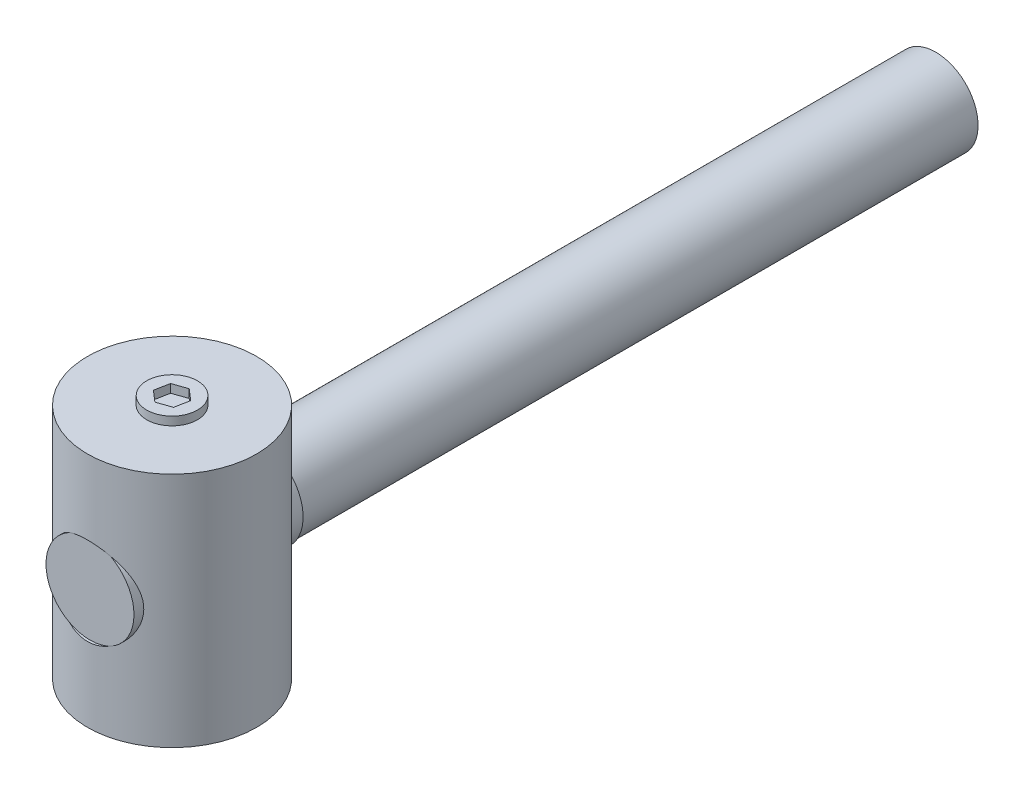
ISO-10303-21;
HEADER;
FILE_DESCRIPTION(('STEP AP214'),'2;1');
FILE_NAME('part.step','',(''),(''),'','','');
FILE_SCHEMA(('AUTOMOTIVE_DESIGN { 1 0 10303 214 1 1 1 1 }'));
ENDSEC;
DATA;
#1=APPLICATION_CONTEXT('core data for automotive mechanical design processes');
#2=APPLICATION_PROTOCOL_DEFINITION('international standard','automotive_design',2000,#1);
#3=PRODUCT_CONTEXT('',#1,'mechanical');
#4=PRODUCT('Part','Part','',(#3));
#5=PRODUCT_RELATED_PRODUCT_CATEGORY('part','',(#4));
#6=PRODUCT_DEFINITION_FORMATION('','',#4);
#7=PRODUCT_DEFINITION_CONTEXT('part definition',#1,'design');
#8=PRODUCT_DEFINITION('design','',#6,#7);
#9=PRODUCT_DEFINITION_SHAPE('','',#8);
#10=(LENGTH_UNIT() NAMED_UNIT(*) SI_UNIT(.MILLI.,.METRE.));
#11=(NAMED_UNIT(*) PLANE_ANGLE_UNIT() SI_UNIT($,.RADIAN.));
#12=(NAMED_UNIT(*) SI_UNIT($,.STERADIAN.) SOLID_ANGLE_UNIT());
#13=UNCERTAINTY_MEASURE_WITH_UNIT(LENGTH_MEASURE(1.E-05),#10,'distance_accuracy_value','');
#14=(GEOMETRIC_REPRESENTATION_CONTEXT(3) GLOBAL_UNCERTAINTY_ASSIGNED_CONTEXT((#13)) GLOBAL_UNIT_ASSIGNED_CONTEXT((#10,
#11,#12)) REPRESENTATION_CONTEXT('',''));
#15=CARTESIAN_POINT('',(0.,0.,0.));
#16=DIRECTION('',(0.,0.,1.));
#17=DIRECTION('',(1.,0.,0.));
#18=AXIS2_PLACEMENT_3D('',#15,#16,#17);
#19=CARTESIAN_POINT('',(0.,-7.,0.));
#20=DIRECTION('',(0.,1.,0.));
#21=DIRECTION('',(-1.,0.,0.));
#22=AXIS2_PLACEMENT_3D('',#19,#20,#21);
#23=CYLINDRICAL_SURFACE('',#22,5.);
#24=CARTESIAN_POINT('',(0.,-7.,0.));
#25=DIRECTION('',(0.,-1.,0.));
#26=DIRECTION('',(1.,0.,0.));
#27=AXIS2_PLACEMENT_3D('',#24,#25,#26);
#28=CIRCLE('',#27,5.);
#29=CARTESIAN_POINT('',(5.,-7.,0.));
#30=VERTEX_POINT('',#29);
#31=EDGE_CURVE('E157',#30,#30,#28,.T.);
#32=ORIENTED_EDGE('',*,*,#31,.F.);
#33=EDGE_LOOP('',(#32));
#34=FACE_BOUND('',#33,.T.);
#35=CARTESIAN_POINT('',(0.,7.,0.));
#36=DIRECTION('',(0.,-1.,0.));
#37=DIRECTION('',(1.,0.,0.));
#38=AXIS2_PLACEMENT_3D('',#35,#36,#37);
#39=CIRCLE('',#38,5.);
#40=CARTESIAN_POINT('',(5.,7.,0.));
#41=VERTEX_POINT('',#40);
#42=EDGE_CURVE('E124',#41,#41,#39,.T.);
#43=ORIENTED_EDGE('',*,*,#42,.T.);
#44=EDGE_LOOP('',(#43));
#45=FACE_BOUND('',#44,.T.);
#46=CARTESIAN_POINT('',(1.3,-2.25166604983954,-4.8280430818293));
#47=CARTESIAN_POINT('',(1.43082347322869,-2.17613041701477,-4.79281274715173));
#48=CARTESIAN_POINT('',(1.55444447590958,-2.08952355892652,-4.75378790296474));
#49=CARTESIAN_POINT('',(1.78454989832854,-1.89684283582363,-4.67229914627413));
#50=CARTESIAN_POINT('',(1.89098389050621,-1.79071357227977,-4.62982564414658));
#51=CARTESIAN_POINT('',(2.08420473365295,-1.56158048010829,-4.54611438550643));
#52=CARTESIAN_POINT('',(2.17100755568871,-1.43859050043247,-4.50487564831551));
#53=CARTESIAN_POINT('',(2.32271575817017,-1.1779818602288,-4.42856997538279));
#54=CARTESIAN_POINT('',(2.38764225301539,-1.04037747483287,-4.39349710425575));
#55=CARTESIAN_POINT('',(2.46595873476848,-0.827406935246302,-4.34970179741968));
#56=CARTESIAN_POINT('',(2.48871434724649,-0.756252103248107,-4.33668270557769));
#57=CARTESIAN_POINT('',(2.52810522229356,-0.611783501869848,-4.3138387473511));
#58=CARTESIAN_POINT('',(2.54474389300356,-0.538470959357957,-4.30401210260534));
#59=CARTESIAN_POINT('',(2.57163027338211,-0.390353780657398,-4.28800252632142));
#60=CARTESIAN_POINT('',(2.58188372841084,-0.315550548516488,-4.28181631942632));
#61=CARTESIAN_POINT('',(2.5958506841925,-0.165143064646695,-4.27336143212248));
#62=CARTESIAN_POINT('',(2.59956520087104,-0.0895389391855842,-4.27109214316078));
#63=CARTESIAN_POINT('',(2.6006477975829,0.11638936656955,-4.27044356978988));
#64=CARTESIAN_POINT('',(2.59150358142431,0.246838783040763,-4.27605204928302));
#65=CARTESIAN_POINT('',(2.55402251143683,0.503868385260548,-4.29853605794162));
#66=CARTESIAN_POINT('',(2.52568032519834,0.630447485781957,-4.31541471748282));
#67=CARTESIAN_POINT('',(2.45183589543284,0.874324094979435,-4.3577815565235));
#68=CARTESIAN_POINT('',(2.40665517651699,0.991748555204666,-4.38310754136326));
#69=CARTESIAN_POINT('',(2.30060316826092,1.21771266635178,-4.43968786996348));
#70=CARTESIAN_POINT('',(2.23972628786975,1.32624913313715,-4.47094432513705));
#71=CARTESIAN_POINT('',(2.09474942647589,1.54648172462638,-4.54084877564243));
#72=CARTESIAN_POINT('',(2.00865146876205,1.65672757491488,-4.57992862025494));
#73=CARTESIAN_POINT('',(1.81991423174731,1.86209107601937,-4.65814935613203));
#74=CARTESIAN_POINT('',(1.7172636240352,1.95719827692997,-4.69729027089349));
#75=CARTESIAN_POINT('',(1.48782333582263,2.13762229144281,-4.77517038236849));
#76=CARTESIAN_POINT('',(1.35972503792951,2.22142577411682,-4.81359427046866));
#77=CARTESIAN_POINT('',(1.08901824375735,2.36591075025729,-4.88195400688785));
#78=CARTESIAN_POINT('',(0.946418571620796,2.42660619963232,-4.9118949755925));
#79=CARTESIAN_POINT('',(0.660494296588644,2.51889024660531,-4.9581570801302));
#80=CARTESIAN_POINT('',(0.517827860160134,2.55212373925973,-4.97524130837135));
#81=CARTESIAN_POINT('',(0.228040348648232,2.5941060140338,-4.99690393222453));
#82=CARTESIAN_POINT('',(0.080922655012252,2.60287293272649,-5.00149159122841));
#83=CARTESIAN_POINT('',(-0.197852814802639,2.59583206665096,-4.9978348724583));
#84=CARTESIAN_POINT('',(-0.329594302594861,2.58237944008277,-4.99082017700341));
#85=CARTESIAN_POINT('',(-0.588635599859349,2.53590678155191,-4.96693327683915));
#86=CARTESIAN_POINT('',(-0.715935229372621,2.50288595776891,-4.95006067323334));
#87=CARTESIAN_POINT('',(-0.963054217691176,2.41859700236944,-4.90798145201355));
#88=CARTESIAN_POINT('',(-1.08286119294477,2.3672995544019,-4.88276144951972));
#89=CARTESIAN_POINT('',(-1.31236116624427,2.2482079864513,-4.82614733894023));
#90=CARTESIAN_POINT('',(-1.42205105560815,2.18040881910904,-4.79475134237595));
#91=CARTESIAN_POINT('',(-1.63946228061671,2.02283839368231,-4.7250829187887));
#92=CARTESIAN_POINT('',(-1.74599052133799,1.93158530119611,-4.6864399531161));
#93=CARTESIAN_POINT('',(-1.9429742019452,1.7333211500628,-4.60826495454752));
#94=CARTESIAN_POINT('',(-2.03341550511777,1.62629638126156,-4.56873217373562));
#95=CARTESIAN_POINT('',(-2.2030656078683,1.38905775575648,-4.48953925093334));
#96=CARTESIAN_POINT('',(-2.28075240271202,1.25766359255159,-4.45013273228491));
#97=CARTESIAN_POINT('',(-2.41256068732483,0.981267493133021,-4.380088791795));
#98=CARTESIAN_POINT('',(-2.46670227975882,0.83627729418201,-4.34944389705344));
#99=CARTESIAN_POINT('',(-2.52681737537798,0.61682763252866,-4.3145874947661));
#100=CARTESIAN_POINT('',(-2.54308972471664,0.545909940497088,-4.30498876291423));
#101=CARTESIAN_POINT('',(-2.56967004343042,0.402608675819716,-4.28917713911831));
#102=CARTESIAN_POINT('',(-2.57998129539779,0.33022593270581,-4.28296238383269));
#103=CARTESIAN_POINT('',(-2.59446337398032,0.18467441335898,-4.27420550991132));
#104=CARTESIAN_POINT('',(-2.59863830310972,0.1115061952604,-4.27166093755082));
#105=CARTESIAN_POINT('',(-2.60079785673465,-0.0349319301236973,-4.27034489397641));
#106=CARTESIAN_POINT('',(-2.59878312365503,-0.108201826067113,-4.27157303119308));
#107=CARTESIAN_POINT('',(-2.58480725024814,-0.308050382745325,-4.2800612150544));
#108=CARTESIAN_POINT('',(-2.56660734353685,-0.434099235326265,-4.29110126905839));
#109=CARTESIAN_POINT('',(-2.5124380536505,-0.680933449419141,-4.3230323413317));
#110=CARTESIAN_POINT('',(-2.47646219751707,-0.801716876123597,-4.343926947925));
#111=CARTESIAN_POINT('',(-2.38692669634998,-1.03878867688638,-4.39377582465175));
#112=CARTESIAN_POINT('',(-2.33290221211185,-1.15485599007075,-4.42293969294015));
#113=CARTESIAN_POINT('',(-2.20916180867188,-1.37687354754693,-4.48602514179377));
#114=CARTESIAN_POINT('',(-2.13943861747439,-1.48281907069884,-4.51994892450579));
#115=CARTESIAN_POINT('',(-1.97500467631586,-1.69706491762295,-4.59440733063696));
#116=CARTESIAN_POINT('',(-1.87816844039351,-1.80364878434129,-4.63520575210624));
#117=CARTESIAN_POINT('',(-1.66780789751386,-1.99977754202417,-4.71498418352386));
#118=CARTESIAN_POINT('',(-1.55427472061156,-2.08931331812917,-4.75396321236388));
#119=CARTESIAN_POINT('',(-1.30655803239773,-2.25300013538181,-4.82808630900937));
#120=CARTESIAN_POINT('',(-1.17162691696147,-2.32616092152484,-4.86294207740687));
#121=CARTESIAN_POINT('',(-0.889095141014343,-2.448085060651,-4.92242581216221));
#122=CARTESIAN_POINT('',(-0.741506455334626,-2.4968711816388,-4.94706331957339));
#123=CARTESIAN_POINT('',(-0.45201824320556,-2.56432345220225,-4.9814653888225));
#124=CARTESIAN_POINT('',(-0.310791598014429,-2.58529438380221,-4.99236364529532));
#125=CARTESIAN_POINT('',(-0.0263743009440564,-2.60376325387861,-5.00195069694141));
#126=CARTESIAN_POINT('',(0.116815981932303,-2.6012655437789,-5.00064175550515));
#127=CARTESIAN_POINT('',(0.38843535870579,-2.57414292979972,-4.98659254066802));
#128=CARTESIAN_POINT('',(0.517106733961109,-2.55136287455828,-4.97480547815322));
#129=CARTESIAN_POINT('',(0.768393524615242,-2.48723704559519,-4.94222478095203));
#130=CARTESIAN_POINT('',(0.891016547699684,-2.44591529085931,-4.92144279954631));
#131=CARTESIAN_POINT('',(1.05934169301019,-2.37503029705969,-4.88676145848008));
#132=CARTESIAN_POINT('',(1.10869590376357,-2.35238754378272,-4.87578497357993));
#133=CARTESIAN_POINT('',(1.20567242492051,-2.3041883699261,-4.85271435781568));
#134=CARTESIAN_POINT('',(1.2532952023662,-2.27863274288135,-4.84062053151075));
#135=CARTESIAN_POINT('',(1.3,-2.25166604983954,-4.8280430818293));
#136=B_SPLINE_CURVE_WITH_KNOTS('',3,(#46,#47,#48,#49,#50,#51,#52,#53,#54,#55,#56,#57,#58,#59,
#60,#61,#62,#63,#64,#65,#66,#67,#68,#69,#70,#71,#72,#73,#74,#75,#76,#77,#78,#79,#80,#81,#82,#83,
#84,#85,#86,#87,#88,#89,#90,#91,#92,#93,#94,#95,#96,#97,#98,#99,#100,#101,#102,#103,#104,#105,
#106,#107,#108,#109,#110,#111,#112,#113,#114,#115,#116,#117,#118,#119,#120,#121,#122,#123,#124,
#125,#126,#127,#128,#129,#130,#131,#132,#133,#134,#135),.UNSPECIFIED.,.T.,.F.,(4,2,2,2,2,2,2,2,
2,2,2,2,2,2,2,2,2,2,2,2,2,2,2,2,2,2,2,2,2,2,2,2,2,2,2,2,2,2,2,2,2,2,2,2,4),(0.,
0.465144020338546,0.931628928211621,1.39773294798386,1.86338580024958,2.09059401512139,
2.31767544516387,2.54455225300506,2.77139380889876,3.1618958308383,3.55250636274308,
3.93601157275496,4.31965357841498,4.75357689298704,5.18779844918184,5.65882836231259,
6.12957334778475,6.56951134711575,7.00912314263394,7.40505575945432,7.80100439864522,
8.19759103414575,8.59429912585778,9.02897409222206,9.46402917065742,9.93463867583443,
10.404845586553,10.624742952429,10.8445191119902,11.0641482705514,11.2837546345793,
11.6652928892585,12.0469701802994,12.4393515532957,12.8319150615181,13.2789985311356,
13.7263203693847,14.195956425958,14.665152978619,15.0923600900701,15.5194879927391,
15.9113332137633,16.3026722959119,16.4687767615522,16.6348360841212),.UNSPECIFIED.);
#137=CARTESIAN_POINT('',(1.3,-2.25166604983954,-4.8280430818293));
#138=VERTEX_POINT('',#137);
#139=EDGE_CURVE('E106',#138,#138,#136,.T.);
#140=ORIENTED_EDGE('',*,*,#139,.T.);
#141=EDGE_LOOP('',(#140));
#142=FACE_BOUND('',#141,.T.);
#143=CARTESIAN_POINT('',(1.20751645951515,2.30258637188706,4.852));
#144=CARTESIAN_POINT('',(1.14916911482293,2.33319023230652,4.86652788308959));
#145=CARTESIAN_POINT('',(1.08948875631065,2.36165393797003,4.88025585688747));
#146=CARTESIAN_POINT('',(0.967768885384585,2.41408589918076,4.90584096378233));
#147=CARTESIAN_POINT('',(0.905728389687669,2.43805225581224,4.91769730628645));
#148=CARTESIAN_POINT('',(0.779609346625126,2.4812603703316,4.93926149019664));
#149=CARTESIAN_POINT('',(0.71552967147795,2.50049946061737,4.94896811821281));
#150=CARTESIAN_POINT('',(0.585807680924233,2.53403339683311,4.96599638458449));
#151=CARTESIAN_POINT('',(0.520165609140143,2.54832900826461,4.97331839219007));
#152=CARTESIAN_POINT('',(0.321152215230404,2.5835999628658,4.99144751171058));
#153=CARTESIAN_POINT('',(0.185939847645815,2.59687469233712,4.99837456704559));
#154=CARTESIAN_POINT('',(-0.084853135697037,2.60214266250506,5.00111449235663));
#155=CARTESIAN_POINT('',(-0.220433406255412,2.59415159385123,4.99693555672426));
#156=CARTESIAN_POINT('',(-0.482955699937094,2.55805841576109,4.97829711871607));
#157=CARTESIAN_POINT('',(-0.610031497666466,2.53071473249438,4.96422544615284));
#158=CARTESIAN_POINT('',(-0.857441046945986,2.45792479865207,4.92751476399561));
#159=CARTESIAN_POINT('',(-0.977781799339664,2.41249775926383,4.90488484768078));
#160=CARTESIAN_POINT('',(-1.13200743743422,2.34102154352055,4.87033398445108));
#161=CARTESIAN_POINT('',(-1.17004716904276,2.32224226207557,4.86133083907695));
#162=CARTESIAN_POINT('',(-1.20751645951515,2.30258637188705,4.852));
#163=B_SPLINE_CURVE_WITH_KNOTS('',3,(#143,#144,#145,#146,#147,#148,#149,#150,#151,#152,#153,
#154,#155,#156,#157,#158,#159,#160,#161,#162),.UNSPECIFIED.,.F.,.F.,(4,2,2,2,2,2,2,2,2,4),(0.,
0.202369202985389,0.404823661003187,0.607392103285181,0.809929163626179,1.21578454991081,
1.6213405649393,2.01182483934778,2.40189537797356,2.53193143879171),.UNSPECIFIED.);
#164=CARTESIAN_POINT('',(1.20751645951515,2.30258637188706,4.852));
#165=VERTEX_POINT('',#164);
#166=CARTESIAN_POINT('',(-1.20751645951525,2.302586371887,4.852));
#167=VERTEX_POINT('',#166);
#168=EDGE_CURVE('E9',#165,#167,#163,.T.);
#169=ORIENTED_EDGE('',*,*,#168,.F.);
#170=CARTESIAN_POINT('',(1.20751645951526,2.302586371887,4.852));
#171=CARTESIAN_POINT('',(1.27451466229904,2.26744767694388,4.83533027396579));
#172=CARTESIAN_POINT('',(1.33973071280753,2.22952176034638,4.81762139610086));
#173=CARTESIAN_POINT('',(1.46628925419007,2.148406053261,4.78062073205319));
#174=CARTESIAN_POINT('',(1.52763337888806,2.10521850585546,4.76132962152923));
#175=CARTESIAN_POINT('',(1.70547082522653,1.96818562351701,4.70180481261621));
#176=CARTESIAN_POINT('',(1.81577697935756,1.86686594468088,4.65991761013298));
#177=CARTESIAN_POINT('',(2.01731995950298,1.64701621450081,4.57628116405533));
#178=CARTESIAN_POINT('',(2.10857526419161,1.52850303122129,4.53453182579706));
#179=CARTESIAN_POINT('',(2.27005597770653,1.27641915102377,4.45588465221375));
#180=CARTESIAN_POINT('',(2.34028376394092,1.14285015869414,4.41898626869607));
#181=CARTESIAN_POINT('',(2.45668067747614,0.864420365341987,4.35535879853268));
#182=CARTESIAN_POINT('',(2.50303835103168,0.719658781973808,4.32855048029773));
#183=CARTESIAN_POINT('',(2.55319739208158,0.496985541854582,4.29901586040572));
#184=CARTESIAN_POINT('',(2.56668690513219,0.421851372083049,4.29095105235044));
#185=CARTESIAN_POINT('',(2.58703120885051,0.270383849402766,4.27871577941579));
#186=CARTESIAN_POINT('',(2.59388715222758,0.194050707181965,4.27454463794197));
#187=CARTESIAN_POINT('',(2.60331254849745,-0.0146957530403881,4.26882549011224));
#188=CARTESIAN_POINT('',(2.59916112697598,-0.147608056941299,4.27137751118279));
#189=CARTESIAN_POINT('',(2.57081222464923,-0.410402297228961,4.2884925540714));
#190=CARTESIAN_POINT('',(2.5466116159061,-0.540283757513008,4.30305745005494));
#191=CARTESIAN_POINT('',(2.48084284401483,-0.788147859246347,4.34128789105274));
#192=CARTESIAN_POINT('',(2.44004328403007,-0.906400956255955,4.36454739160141));
#193=CARTESIAN_POINT('',(2.3426449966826,-1.13465093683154,4.41758747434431));
#194=CARTESIAN_POINT('',(2.28603701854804,-1.24464293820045,4.44737187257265));
#195=CARTESIAN_POINT('',(2.15060548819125,-1.46763135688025,4.51456303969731));
#196=CARTESIAN_POINT('',(2.06990883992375,-1.57934190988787,4.55245664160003));
#197=CARTESIAN_POINT('',(1.8921621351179,-1.78844573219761,4.62915506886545));
#198=CARTESIAN_POINT('',(1.79511973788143,-1.88584566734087,4.66795946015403));
#199=CARTESIAN_POINT('',(1.61705501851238,-2.03827082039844,4.73194088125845));
#200=CARTESIAN_POINT('',(1.53969689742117,-2.09734036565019,4.75777335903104));
#201=CARTESIAN_POINT('',(1.37839449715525,-2.20669757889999,4.806992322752));
#202=CARTESIAN_POINT('',(1.29445578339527,-2.25699255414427,4.83038083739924));
#203=CARTESIAN_POINT('',(1.20751645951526,-2.302586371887,4.852));
#204=B_SPLINE_CURVE_WITH_KNOTS('',3,(#170,#171,#172,#173,#174,#175,#176,#177,#178,#179,#180,
#181,#182,#183,#184,#185,#186,#187,#188,#189,#190,#191,#192,#193,#194,#195,#196,#197,#198,#199,
#200,#201,#202,#203),.UNSPECIFIED.,.F.,.F.,(4,2,2,2,2,2,2,2,2,2,2,2,2,2,2,2,4),(0.,
0.232231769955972,0.464364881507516,0.928604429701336,1.39239156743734,1.85612624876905,
2.31613949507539,2.54607496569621,2.77597047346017,3.17269389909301,3.56947923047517,
3.9496716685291,4.33008705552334,4.75715632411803,5.18402603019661,5.48554024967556,
5.78680216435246),.UNSPECIFIED.);
#205=CARTESIAN_POINT('',(1.20751645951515,-2.30258637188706,4.852));
#206=VERTEX_POINT('',#205);
#207=EDGE_CURVE('E98',#165,#206,#204,.T.);
#208=ORIENTED_EDGE('',*,*,#207,.T.);
#209=CARTESIAN_POINT('',(-1.20751645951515,-2.30258637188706,4.852));
#210=CARTESIAN_POINT('',(-1.14916911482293,-2.33319023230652,4.86652788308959));
#211=CARTESIAN_POINT('',(-1.08948875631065,-2.36165393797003,4.88025585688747));
#212=CARTESIAN_POINT('',(-0.967768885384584,-2.41408589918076,4.90584096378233));
#213=CARTESIAN_POINT('',(-0.905728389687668,-2.43805225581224,4.91769730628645));
#214=CARTESIAN_POINT('',(-0.779609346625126,-2.4812603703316,4.93926149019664));
#215=CARTESIAN_POINT('',(-0.71552967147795,-2.50049946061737,4.94896811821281));
#216=CARTESIAN_POINT('',(-0.585807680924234,-2.53403339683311,4.96599638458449));
#217=CARTESIAN_POINT('',(-0.520165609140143,-2.54832900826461,4.97331839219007));
#218=CARTESIAN_POINT('',(-0.321152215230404,-2.5835999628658,4.99144751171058));
#219=CARTESIAN_POINT('',(-0.185939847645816,-2.59687469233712,4.99837456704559));
#220=CARTESIAN_POINT('',(0.0848531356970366,-2.60214266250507,5.00111449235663));
#221=CARTESIAN_POINT('',(0.220433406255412,-2.59415159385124,4.99693555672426));
#222=CARTESIAN_POINT('',(0.482955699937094,-2.55805841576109,4.97829711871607));
#223=CARTESIAN_POINT('',(0.610031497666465,-2.53071473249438,4.96422544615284));
#224=CARTESIAN_POINT('',(0.857441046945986,-2.45792479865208,4.92751476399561));
#225=CARTESIAN_POINT('',(0.977781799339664,-2.41249775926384,4.90488484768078));
#226=CARTESIAN_POINT('',(1.13200743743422,-2.34102154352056,4.87033398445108));
#227=CARTESIAN_POINT('',(1.17004716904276,-2.32224226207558,4.86133083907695));
#228=CARTESIAN_POINT('',(1.20751645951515,-2.30258637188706,4.852));
#229=B_SPLINE_CURVE_WITH_KNOTS('',3,(#209,#210,#211,#212,#213,#214,#215,#216,#217,#218,#219,
#220,#221,#222,#223,#224,#225,#226,#227,#228),.UNSPECIFIED.,.F.,.F.,(4,2,2,2,2,2,2,2,2,4),(0.,
0.20236920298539,0.404823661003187,0.60739210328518,0.809929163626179,1.21578454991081,
1.6213405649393,2.01182483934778,2.40189537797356,2.53193143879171),.UNSPECIFIED.);
#230=CARTESIAN_POINT('',(-1.20751645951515,-2.30258637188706,4.852));
#231=VERTEX_POINT('',#230);
#232=EDGE_CURVE('E28',#231,#206,#229,.T.);
#233=ORIENTED_EDGE('',*,*,#232,.F.);
#234=CARTESIAN_POINT('',(-1.20751645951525,-2.302586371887,4.852));
#235=CARTESIAN_POINT('',(-1.27451466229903,-2.26744767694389,4.83533027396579));
#236=CARTESIAN_POINT('',(-1.33973071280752,-2.22952176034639,4.81762139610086));
#237=CARTESIAN_POINT('',(-1.46628925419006,-2.14840605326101,4.78062073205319));
#238=CARTESIAN_POINT('',(-1.52763337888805,-2.10521850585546,4.76132962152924));
#239=CARTESIAN_POINT('',(-1.70547082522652,-1.96818562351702,4.70180481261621));
#240=CARTESIAN_POINT('',(-1.81577697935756,-1.86686594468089,4.65991761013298));
#241=CARTESIAN_POINT('',(-2.01731995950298,-1.64701621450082,4.57628116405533));
#242=CARTESIAN_POINT('',(-2.1085752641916,-1.5285030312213,4.53453182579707));
#243=CARTESIAN_POINT('',(-2.27005597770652,-1.27641915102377,4.45588465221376));
#244=CARTESIAN_POINT('',(-2.34028376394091,-1.14285015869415,4.41898626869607));
#245=CARTESIAN_POINT('',(-2.45668067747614,-0.864420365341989,4.35535879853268));
#246=CARTESIAN_POINT('',(-2.50303835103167,-0.719658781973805,4.32855048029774));
#247=CARTESIAN_POINT('',(-2.55319739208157,-0.496985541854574,4.29901586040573));
#248=CARTESIAN_POINT('',(-2.56668690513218,-0.42185137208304,4.29095105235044));
#249=CARTESIAN_POINT('',(-2.5870312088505,-0.270383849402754,4.27871577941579));
#250=CARTESIAN_POINT('',(-2.59388715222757,-0.194050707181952,4.27454463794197));
#251=CARTESIAN_POINT('',(-2.60331254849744,0.0146957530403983,4.26882549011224));
#252=CARTESIAN_POINT('',(-2.59916112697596,0.147608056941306,4.27137751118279));
#253=CARTESIAN_POINT('',(-2.57081222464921,0.410402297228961,4.2884925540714));
#254=CARTESIAN_POINT('',(-2.54661161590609,0.540283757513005,4.30305745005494));
#255=CARTESIAN_POINT('',(-2.48084284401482,0.788147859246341,4.34128789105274));
#256=CARTESIAN_POINT('',(-2.44004328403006,0.906400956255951,4.36454739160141));
#257=CARTESIAN_POINT('',(-2.34264499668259,1.13465093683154,4.41758747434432));
#258=CARTESIAN_POINT('',(-2.28603701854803,1.24464293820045,4.44737187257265));
#259=CARTESIAN_POINT('',(-2.15060548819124,1.46763135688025,4.51456303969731));
#260=CARTESIAN_POINT('',(-2.06990883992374,1.57934190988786,4.55245664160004));
#261=CARTESIAN_POINT('',(-1.89216213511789,1.78844573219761,4.62915506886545));
#262=CARTESIAN_POINT('',(-1.79511973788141,1.88584566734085,4.66795946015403));
#263=CARTESIAN_POINT('',(-1.61705501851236,2.03827082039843,4.73194088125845));
#264=CARTESIAN_POINT('',(-1.53969689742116,2.09734036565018,4.75777335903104));
#265=CARTESIAN_POINT('',(-1.37839449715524,2.20669757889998,4.806992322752));
#266=CARTESIAN_POINT('',(-1.29445578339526,2.25699255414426,4.83038083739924));
#267=CARTESIAN_POINT('',(-1.20751645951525,2.302586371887,4.852));
#268=B_SPLINE_CURVE_WITH_KNOTS('',3,(#234,#235,#236,#237,#238,#239,#240,#241,#242,#243,#244,
#245,#246,#247,#248,#249,#250,#251,#252,#253,#254,#255,#256,#257,#258,#259,#260,#261,#262,#263,
#264,#265,#266,#267),.UNSPECIFIED.,.F.,.F.,(4,2,2,2,2,2,2,2,2,2,2,2,2,2,2,2,4),(0.,
0.23223176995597,0.464364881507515,0.928604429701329,1.39239156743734,1.85612624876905,
2.3161394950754,2.54607496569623,2.77597047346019,3.17269389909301,3.56947923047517,
3.9496716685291,4.33008705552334,4.75715632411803,5.1840260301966,5.48554024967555,
5.78680216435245),.UNSPECIFIED.);
#269=EDGE_CURVE('E101',#231,#167,#268,.T.);
#270=ORIENTED_EDGE('',*,*,#269,.T.);
#271=EDGE_LOOP('',(#169,#208,#233,#270));
#272=FACE_BOUND('',#271,.T.);
#273=ADVANCED_FACE('F14',(#34,#45,#142,#272),#23,.T.);
#274=CARTESIAN_POINT('',(0.,0.,-10.148));
#275=DIRECTION('',(0.,0.,-1.));
#276=DIRECTION('',(-0.5,0.866025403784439,0.));
#277=AXIS2_PLACEMENT_3D('',#274,#275,#276);
#278=CYLINDRICAL_SURFACE('',#277,2.5);
#279=CARTESIAN_POINT('',(0.,0.,-45.148));
#280=DIRECTION('',(0.,0.,1.));
#281=DIRECTION('',(-1.,0.,0.));
#282=AXIS2_PLACEMENT_3D('',#279,#280,#281);
#283=CIRCLE('',#282,2.5);
#284=CARTESIAN_POINT('',(-2.49999999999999,0.,-45.148));
#285=VERTEX_POINT('',#284);
#286=EDGE_CURVE('E111',#285,#285,#283,.F.);
#287=ORIENTED_EDGE('',*,*,#286,.F.);
#288=EDGE_LOOP('',(#287));
#289=FACE_BOUND('',#288,.T.);
#290=CARTESIAN_POINT('',(0.,0.,-5.148));
#291=DIRECTION('',(0.,0.,1.));
#292=DIRECTION('',(0.5,-0.866025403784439,0.));
#293=AXIS2_PLACEMENT_3D('',#290,#291,#292);
#294=CIRCLE('',#293,2.5);
#295=CARTESIAN_POINT('',(1.25000000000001,-2.1650635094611,-5.148));
#296=VERTEX_POINT('',#295);
#297=EDGE_CURVE('E121',#296,#296,#294,.F.);
#298=ORIENTED_EDGE('',*,*,#297,.T.);
#299=EDGE_LOOP('',(#298));
#300=FACE_BOUND('',#299,.T.);
#301=ADVANCED_FACE('F217',(#289,#300),#278,.T.);
#302=CARTESIAN_POINT('',(0.,0.,-5.148));
#303=DIRECTION('',(0.,0.,1.));
#304=DIRECTION('',(0.5,-0.866025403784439,0.));
#305=AXIS2_PLACEMENT_3D('',#302,#303,#304);
#306=PLANE('',#305);
#307=ORIENTED_EDGE('',*,*,#297,.F.);
#308=EDGE_LOOP('',(#307));
#309=FACE_BOUND('',#308,.T.);
#310=CARTESIAN_POINT('',(0.,0.,-5.148));
#311=DIRECTION('',(0.,0.,1.));
#312=DIRECTION('',(0.5,-0.866025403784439,0.));
#313=AXIS2_PLACEMENT_3D('',#310,#311,#312);
#314=CIRCLE('',#313,2.6);
#315=CARTESIAN_POINT('',(1.30000000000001,-2.25166604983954,-5.148));
#316=VERTEX_POINT('',#315);
#317=EDGE_CURVE('E113',#316,#316,#314,.T.);
#318=ORIENTED_EDGE('',*,*,#317,.F.);
#319=EDGE_LOOP('',(#318));
#320=FACE_BOUND('',#319,.T.);
#321=ADVANCED_FACE('F145',(#309,#320),#306,.F.);
#322=CARTESIAN_POINT('',(0.,0.,-5.148));
#323=DIRECTION('',(0.,0.,1.));
#324=DIRECTION('',(0.5,-0.866025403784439,0.));
#325=AXIS2_PLACEMENT_3D('',#322,#323,#324);
#326=CYLINDRICAL_SURFACE('',#325,2.6);
#327=ORIENTED_EDGE('',*,*,#269,.F.);
#328=CARTESIAN_POINT('',(0.,0.,4.852));
#329=DIRECTION('',(0.,0.,1.));
#330=DIRECTION('',(0.5,-0.866025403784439,0.));
#331=AXIS2_PLACEMENT_3D('',#328,#329,#330);
#332=CIRCLE('',#331,2.6);
#333=EDGE_CURVE('E110',#167,#231,#332,.T.);
#334=ORIENTED_EDGE('',*,*,#333,.F.);
#335=EDGE_LOOP('',(#327,#334));
#336=FACE_BOUND('',#335,.T.);
#337=ADVANCED_FACE('F144',(#336),#326,.T.);
#338=CARTESIAN_POINT('',(0.,0.,4.852));
#339=DIRECTION('',(0.,0.,1.));
#340=DIRECTION('',(0.5,-0.866025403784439,0.));
#341=AXIS2_PLACEMENT_3D('',#338,#339,#340);
#342=PLANE('',#341);
#343=EDGE_CURVE('E105',#206,#165,#332,.T.);
#344=ORIENTED_EDGE('',*,*,#343,.T.);
#345=CARTESIAN_POINT('',(0.,0.,4.852));
#346=DIRECTION('',(0.,0.,1.));
#347=DIRECTION('',(1.,0.,0.));
#348=AXIS2_PLACEMENT_3D('',#345,#346,#347);
#349=CIRCLE('',#348,2.6);
#350=EDGE_CURVE('E84',#165,#167,#349,.T.);
#351=ORIENTED_EDGE('',*,*,#350,.T.);
#352=ORIENTED_EDGE('',*,*,#333,.T.);
#353=EDGE_CURVE('E92',#231,#206,#349,.T.);
#354=ORIENTED_EDGE('',*,*,#353,.T.);
#355=EDGE_LOOP('',(#344,#351,#352,#354));
#356=FACE_BOUND('',#355,.T.);
#357=ADVANCED_FACE('F109',(#356),#342,.T.);
#358=ORIENTED_EDGE('',*,*,#207,.F.);
#359=ORIENTED_EDGE('',*,*,#343,.F.);
#360=EDGE_LOOP('',(#358,#359));
#361=FACE_BOUND('',#360,.T.);
#362=ADVANCED_FACE('F104',(#361),#326,.T.);
#363=ORIENTED_EDGE('',*,*,#317,.T.);
#364=EDGE_LOOP('',(#363));
#365=FACE_BOUND('',#364,.T.);
#366=ORIENTED_EDGE('',*,*,#139,.F.);
#367=EDGE_LOOP('',(#366));
#368=FACE_BOUND('',#367,.T.);
#369=ADVANCED_FACE('F143',(#365,#368),#326,.T.);
#370=CARTESIAN_POINT('',(-2.125,3.68060796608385,-45.148));
#371=DIRECTION('',(0.,0.,1.));
#372=DIRECTION('',(0.5,-0.866025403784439,0.));
#373=AXIS2_PLACEMENT_3D('',#370,#371,#372);
#374=PLANE('',#373);
#375=ORIENTED_EDGE('',*,*,#286,.T.);
#376=EDGE_LOOP('',(#375));
#377=FACE_BOUND('',#376,.T.);
#378=ADVANCED_FACE('F203',(#377),#374,.F.);
#379=CARTESIAN_POINT('',(0.654342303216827,6.3,0.567306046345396));
#380=DIRECTION('',(0.981876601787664,0.,0.189521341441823));
#381=DIRECTION('',(0.189521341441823,0.,-0.981876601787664));
#382=AXIS2_PLACEMENT_3D('',#379,#380,#381);
#383=PLANE('',#382);
#384=DIRECTION('',(0.,1.,0.));
#385=VECTOR('',#384,1.);
#386=CARTESIAN_POINT('',(0.818472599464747,6.3,-0.283024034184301));
#387=LINE('',#386,#385);
#388=CARTESIAN_POINT('',(0.818472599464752,7.,-0.283024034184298));
#389=VERTEX_POINT('',#388);
#390=CARTESIAN_POINT('',(0.818472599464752,7.5,-0.283024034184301));
#391=VERTEX_POINT('',#390);
#392=EDGE_CURVE('E182',#389,#391,#387,.T.);
#393=ORIENTED_EDGE('',*,*,#392,.F.);
#394=DIRECTION('',(-0.189521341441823,0.,0.981876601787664));
#395=VECTOR('',#394,1.);
#396=CARTESIAN_POINT('',(0.654342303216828,7.,0.567306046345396));
#397=LINE('',#396,#395);
#398=CARTESIAN_POINT('',(0.654342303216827,7.,0.567306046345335));
#399=VERTEX_POINT('',#398);
#400=EDGE_CURVE('E115',#389,#399,#397,.T.);
#401=ORIENTED_EDGE('',*,*,#400,.T.);
#402=DIRECTION('',(0.,1.,0.));
#403=VECTOR('',#402,1.);
#404=CARTESIAN_POINT('',(0.654342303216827,6.3,0.567306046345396));
#405=LINE('',#404,#403);
#406=CARTESIAN_POINT('',(0.654342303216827,7.5,0.567306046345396));
#407=VERTEX_POINT('',#406);
#408=EDGE_CURVE('E184',#399,#407,#405,.T.);
#409=ORIENTED_EDGE('',*,*,#408,.T.);
#410=DIRECTION('',(0.189521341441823,0.,-0.981876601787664));
#411=VECTOR('',#410,1.);
#412=CARTESIAN_POINT('',(0.654342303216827,7.5,0.567306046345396));
#413=LINE('',#412,#411);
#414=EDGE_CURVE('E163',#407,#391,#413,.T.);
#415=ORIENTED_EDGE('',*,*,#414,.T.);
#416=EDGE_LOOP('',(#393,#401,#409,#415));
#417=FACE_BOUND('',#416,.T.);
#418=ADVANCED_FACE('F205',(#417),#383,.F.);
#419=CARTESIAN_POINT('',(0.818472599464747,6.3,-0.283024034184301));
#420=DIRECTION('',(0.655068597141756,0.,-0.755569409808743));
#421=DIRECTION('',(-0.755569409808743,0.,-0.655068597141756));
#422=AXIS2_PLACEMENT_3D('',#419,#420,#421);
#423=PLANE('',#422);
#424=DIRECTION('',(0.,1.,0.));
#425=VECTOR('',#424,1.);
#426=CARTESIAN_POINT('',(0.164130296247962,6.3,-0.850330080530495));
#427=LINE('',#426,#425);
#428=CARTESIAN_POINT('',(0.164130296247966,7.,-0.850330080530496));
#429=VERTEX_POINT('',#428);
#430=CARTESIAN_POINT('',(0.164130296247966,7.5,-0.850330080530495));
#431=VERTEX_POINT('',#430);
#432=EDGE_CURVE('E180',#429,#431,#427,.T.);
#433=ORIENTED_EDGE('',*,*,#432,.F.);
#434=DIRECTION('',(0.755569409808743,0.,0.655068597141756));
#435=VECTOR('',#434,1.);
#436=CARTESIAN_POINT('',(0.818472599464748,7.,-0.283024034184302));
#437=LINE('',#436,#435);
#438=EDGE_CURVE('E280',#429,#389,#437,.T.);
#439=ORIENTED_EDGE('',*,*,#438,.T.);
#440=ORIENTED_EDGE('',*,*,#392,.T.);
#441=DIRECTION('',(-0.755569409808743,0.,-0.655068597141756));
#442=VECTOR('',#441,1.);
#443=CARTESIAN_POINT('',(0.818472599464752,7.5,-0.283024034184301));
#444=LINE('',#443,#442);
#445=EDGE_CURVE('E166',#391,#431,#444,.T.);
#446=ORIENTED_EDGE('',*,*,#445,.T.);
#447=EDGE_LOOP('',(#433,#439,#440,#446));
#448=FACE_BOUND('',#447,.T.);
#449=ADVANCED_FACE('F212',(#448),#423,.F.);
#450=CARTESIAN_POINT('',(0.164130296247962,6.3,-0.850330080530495));
#451=DIRECTION('',(-0.326808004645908,0.,-0.945090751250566));
#452=DIRECTION('',(-0.945090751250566,0.,0.326808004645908));
#453=AXIS2_PLACEMENT_3D('',#450,#451,#452);
#454=PLANE('',#453);
#455=DIRECTION('',(0.,1.,0.));
#456=VECTOR('',#455,1.);
#457=CARTESIAN_POINT('',(-0.654342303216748,6.3,-0.567306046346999));
#458=LINE('',#457,#456);
#459=CARTESIAN_POINT('',(-0.654342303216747,7.,-0.567306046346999));
#460=VERTEX_POINT('',#459);
#461=CARTESIAN_POINT('',(-0.654342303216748,7.5,-0.567306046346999));
#462=VERTEX_POINT('',#461);
#463=EDGE_CURVE('E178',#460,#462,#458,.T.);
#464=ORIENTED_EDGE('',*,*,#463,.F.);
#465=DIRECTION('',(0.945090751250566,0.,-0.326808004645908));
#466=VECTOR('',#465,1.);
#467=CARTESIAN_POINT('',(0.164130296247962,7.,-0.850330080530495));
#468=LINE('',#467,#466);
#469=EDGE_CURVE('E274',#460,#429,#468,.T.);
#470=ORIENTED_EDGE('',*,*,#469,.T.);
#471=ORIENTED_EDGE('',*,*,#432,.T.);
#472=DIRECTION('',(-0.945090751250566,0.,0.326808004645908));
#473=VECTOR('',#472,1.);
#474=CARTESIAN_POINT('',(0.164130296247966,7.5,-0.850330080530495));
#475=LINE('',#474,#473);
#476=EDGE_CURVE('E169',#431,#462,#475,.T.);
#477=ORIENTED_EDGE('',*,*,#476,.T.);
#478=EDGE_LOOP('',(#464,#470,#471,#477));
#479=FACE_BOUND('',#478,.T.);
#480=ADVANCED_FACE('F259',(#479),#454,.F.);
#481=CARTESIAN_POINT('',(-0.654342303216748,6.3,-0.567306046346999));
#482=DIRECTION('',(-0.981876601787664,0.,-0.189521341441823));
#483=DIRECTION('',(-0.189521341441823,0.,0.981876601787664));
#484=AXIS2_PLACEMENT_3D('',#481,#482,#483);
#485=PLANE('',#484);
#486=DIRECTION('',(0.,1.,0.));
#487=VECTOR('',#486,1.);
#488=CARTESIAN_POINT('',(-0.818472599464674,6.3,0.283024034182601));
#489=LINE('',#488,#487);
#490=CARTESIAN_POINT('',(-0.818472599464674,7.,0.2830240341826));
#491=VERTEX_POINT('',#490);
#492=CARTESIAN_POINT('',(-0.818472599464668,7.5,0.283024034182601));
#493=VERTEX_POINT('',#492);
#494=EDGE_CURVE('E175',#491,#493,#489,.T.);
#495=ORIENTED_EDGE('',*,*,#494,.F.);
#496=DIRECTION('',(0.189521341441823,0.,-0.981876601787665));
#497=VECTOR('',#496,1.);
#498=CARTESIAN_POINT('',(-0.654342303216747,7.,-0.567306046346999));
#499=LINE('',#498,#497);
#500=EDGE_CURVE('E269',#491,#460,#499,.T.);
#501=ORIENTED_EDGE('',*,*,#500,.T.);
#502=ORIENTED_EDGE('',*,*,#463,.T.);
#503=DIRECTION('',(-0.189521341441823,0.,0.981876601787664));
#504=VECTOR('',#503,1.);
#505=CARTESIAN_POINT('',(-0.654342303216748,7.5,-0.567306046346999));
#506=LINE('',#505,#504);
#507=EDGE_CURVE('E172',#462,#493,#506,.T.);
#508=ORIENTED_EDGE('',*,*,#507,.T.);
#509=EDGE_LOOP('',(#495,#501,#502,#508));
#510=FACE_BOUND('',#509,.T.);
#511=ADVANCED_FACE('F254',(#510),#485,.F.);
#512=CARTESIAN_POINT('',(-0.818472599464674,6.3,0.283024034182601));
#513=DIRECTION('',(-0.655068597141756,0.,0.755569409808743));
#514=DIRECTION('',(0.755569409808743,0.,0.655068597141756));
#515=AXIS2_PLACEMENT_3D('',#512,#513,#514);
#516=PLANE('',#515);
#517=DIRECTION('',(0.,1.,0.));
#518=VECTOR('',#517,1.);
#519=CARTESIAN_POINT('',(-0.164130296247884,6.3,0.850330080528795));
#520=LINE('',#519,#518);
#521=CARTESIAN_POINT('',(-0.164130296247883,7.,0.850330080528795));
#522=VERTEX_POINT('',#521);
#523=CARTESIAN_POINT('',(-0.164130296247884,7.5,0.850330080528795));
#524=VERTEX_POINT('',#523);
#525=EDGE_CURVE('E42',#522,#524,#520,.T.);
#526=ORIENTED_EDGE('',*,*,#525,.F.);
#527=DIRECTION('',(-0.755569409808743,0.,-0.655068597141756));
#528=VECTOR('',#527,1.);
#529=CARTESIAN_POINT('',(-0.818472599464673,7.,0.283024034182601));
#530=LINE('',#529,#528);
#531=EDGE_CURVE('E35',#522,#491,#530,.T.);
#532=ORIENTED_EDGE('',*,*,#531,.T.);
#533=ORIENTED_EDGE('',*,*,#494,.T.);
#534=DIRECTION('',(0.755569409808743,0.,0.655068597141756));
#535=VECTOR('',#534,1.);
#536=CARTESIAN_POINT('',(-0.818472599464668,7.5,0.283024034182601));
#537=LINE('',#536,#535);
#538=EDGE_CURVE('E131',#493,#524,#537,.T.);
#539=ORIENTED_EDGE('',*,*,#538,.T.);
#540=EDGE_LOOP('',(#526,#532,#533,#539));
#541=FACE_BOUND('',#540,.T.);
#542=ADVANCED_FACE('F249',(#541),#516,.F.);
#543=CARTESIAN_POINT('',(-0.164130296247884,6.3,0.850330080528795));
#544=DIRECTION('',(0.326808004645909,0.,0.945090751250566));
#545=DIRECTION('',(0.945090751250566,0.,-0.326808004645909));
#546=AXIS2_PLACEMENT_3D('',#543,#544,#545);
#547=PLANE('',#546);
#548=ORIENTED_EDGE('',*,*,#408,.F.);
#549=DIRECTION('',(-0.945090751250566,0.,0.326808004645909));
#550=VECTOR('',#549,1.);
#551=CARTESIAN_POINT('',(-0.164130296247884,7.,0.850330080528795));
#552=LINE('',#551,#550);
#553=EDGE_CURVE('E91',#399,#522,#552,.T.);
#554=ORIENTED_EDGE('',*,*,#553,.T.);
#555=ORIENTED_EDGE('',*,*,#525,.T.);
#556=DIRECTION('',(0.945090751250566,0.,-0.326808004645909));
#557=VECTOR('',#556,1.);
#558=CARTESIAN_POINT('',(-0.164130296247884,7.5,0.850330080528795));
#559=LINE('',#558,#557);
#560=EDGE_CURVE('E161',#524,#407,#559,.T.);
#561=ORIENTED_EDGE('',*,*,#560,.T.);
#562=EDGE_LOOP('',(#548,#554,#555,#561));
#563=FACE_BOUND('',#562,.T.);
#564=ADVANCED_FACE('F242',(#563),#547,.F.);
#565=CARTESIAN_POINT('',(0.,7.5,-7.97972798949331E-13));
#566=DIRECTION('',(0.,-1.,0.));
#567=DIRECTION('',(0.189521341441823,0.,-0.981876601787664));
#568=AXIS2_PLACEMENT_3D('',#565,#566,#567);
#569=PLANE('',#568);
#570=ORIENTED_EDGE('',*,*,#560,.F.);
#571=ORIENTED_EDGE('',*,*,#538,.F.);
#572=ORIENTED_EDGE('',*,*,#507,.F.);
#573=ORIENTED_EDGE('',*,*,#476,.F.);
#574=ORIENTED_EDGE('',*,*,#445,.F.);
#575=ORIENTED_EDGE('',*,*,#414,.F.);
#576=EDGE_LOOP('',(#570,#571,#572,#573,#574,#575));
#577=FACE_BOUND('',#576,.T.);
#578=CARTESIAN_POINT('',(0.,7.5,-7.97972798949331E-13));
#579=DIRECTION('',(0.,-1.,0.));
#580=DIRECTION('',(0.189521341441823,0.,-0.981876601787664));
#581=AXIS2_PLACEMENT_3D('',#578,#579,#580);
#582=CIRCLE('',#581,1.5);
#583=CARTESIAN_POINT('',(0.284282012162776,7.5,-1.47281490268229));
#584=VERTEX_POINT('',#583);
#585=EDGE_CURVE('E177',#584,#584,#582,.T.);
#586=ORIENTED_EDGE('',*,*,#585,.F.);
#587=EDGE_LOOP('',(#586));
#588=FACE_BOUND('',#587,.T.);
#589=ADVANCED_FACE('F237',(#577,#588),#569,.F.);
#590=CARTESIAN_POINT('',(0.,4.5,-7.97972798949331E-13));
#591=DIRECTION('',(0.,-1.,0.));
#592=DIRECTION('',(0.189521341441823,0.,-0.981876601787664));
#593=AXIS2_PLACEMENT_3D('',#590,#591,#592);
#594=CYLINDRICAL_SURFACE('',#593,1.5);
#595=ORIENTED_EDGE('',*,*,#585,.T.);
#596=EDGE_LOOP('',(#595));
#597=FACE_BOUND('',#596,.T.);
#598=CARTESIAN_POINT('',(0.,7.,-7.97972798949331E-13));
#599=DIRECTION('',(0.,-1.,0.));
#600=DIRECTION('',(0.,0.,1.));
#601=AXIS2_PLACEMENT_3D('',#598,#599,#600);
#602=CIRCLE('',#601,1.5);
#603=CARTESIAN_POINT('',(0.,7.,1.4999999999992));
#604=VERTEX_POINT('',#603);
#605=EDGE_CURVE('E189',#604,#604,#602,.T.);
#606=ORIENTED_EDGE('',*,*,#605,.F.);
#607=EDGE_LOOP('',(#606));
#608=FACE_BOUND('',#607,.T.);
#609=ADVANCED_FACE('F16',(#597,#608),#594,.T.);
#610=CARTESIAN_POINT('',(0.,7.,0.));
#611=DIRECTION('',(0.,-1.,0.));
#612=DIRECTION('',(1.,0.,0.));
#613=AXIS2_PLACEMENT_3D('',#610,#611,#612);
#614=PLANE('',#613);
#615=ORIENTED_EDGE('',*,*,#42,.F.);
#616=EDGE_LOOP('',(#615));
#617=FACE_BOUND('',#616,.T.);
#618=ORIENTED_EDGE('',*,*,#605,.T.);
#619=EDGE_LOOP('',(#618));
#620=FACE_BOUND('',#619,.T.);
#621=ADVANCED_FACE('F230',(#617,#620),#614,.F.);
#622=CARTESIAN_POINT('',(0.,-7.,0.));
#623=DIRECTION('',(0.,-1.,0.));
#624=DIRECTION('',(1.,0.,0.));
#625=AXIS2_PLACEMENT_3D('',#622,#623,#624);
#626=PLANE('',#625);
#627=ORIENTED_EDGE('',*,*,#31,.T.);
#628=EDGE_LOOP('',(#627));
#629=FACE_BOUND('',#628,.T.);
#630=ADVANCED_FACE('F202',(#629),#626,.T.);
#631=CARTESIAN_POINT('',(0.,7.,-7.97972798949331E-13));
#632=DIRECTION('',(0.,1.,0.));
#633=DIRECTION('',(0.,0.,1.));
#634=AXIS2_PLACEMENT_3D('',#631,#632,#633);
#635=PLANE('',#634);
#636=ORIENTED_EDGE('',*,*,#400,.F.);
#637=ORIENTED_EDGE('',*,*,#438,.F.);
#638=ORIENTED_EDGE('',*,*,#469,.F.);
#639=ORIENTED_EDGE('',*,*,#500,.F.);
#640=ORIENTED_EDGE('',*,*,#531,.F.);
#641=ORIENTED_EDGE('',*,*,#553,.F.);
#642=EDGE_LOOP('',(#636,#637,#638,#639,#640,#641));
#643=FACE_BOUND('',#642,.T.);
#644=ADVANCED_FACE('F199',(#643),#635,.T.);
#645=CARTESIAN_POINT('',(0.,0.,10.852));
#646=DIRECTION('',(0.,0.,-1.));
#647=DIRECTION('',(-1.,0.,0.));
#648=AXIS2_PLACEMENT_3D('',#645,#646,#647);
#649=CYLINDRICAL_SURFACE('',#648,2.6);
#650=ORIENTED_EDGE('',*,*,#232,.T.);
#651=ORIENTED_EDGE('',*,*,#353,.F.);
#652=EDGE_LOOP('',(#650,#651));
#653=FACE_BOUND('',#652,.T.);
#654=ADVANCED_FACE('F198',(#653),#649,.F.);
#655=ORIENTED_EDGE('',*,*,#168,.T.);
#656=ORIENTED_EDGE('',*,*,#350,.F.);
#657=EDGE_LOOP('',(#655,#656));
#658=FACE_BOUND('',#657,.T.);
#659=ADVANCED_FACE('F86',(#658),#649,.F.);
#660=CLOSED_SHELL('',(#273,#301,#321,#337,#357,#362,#369,#378,#418,#449,#480,#511,#542,#564,
#589,#609,#621,#630,#644,#654,#659));
#661=MANIFOLD_SOLID_BREP('B1',#660);
#662=ADVANCED_BREP_SHAPE_REPRESENTATION('',(#18,#661),#14);
#663=SHAPE_DEFINITION_REPRESENTATION(#9,#662);
ENDSEC;
END-ISO-10303-21;
